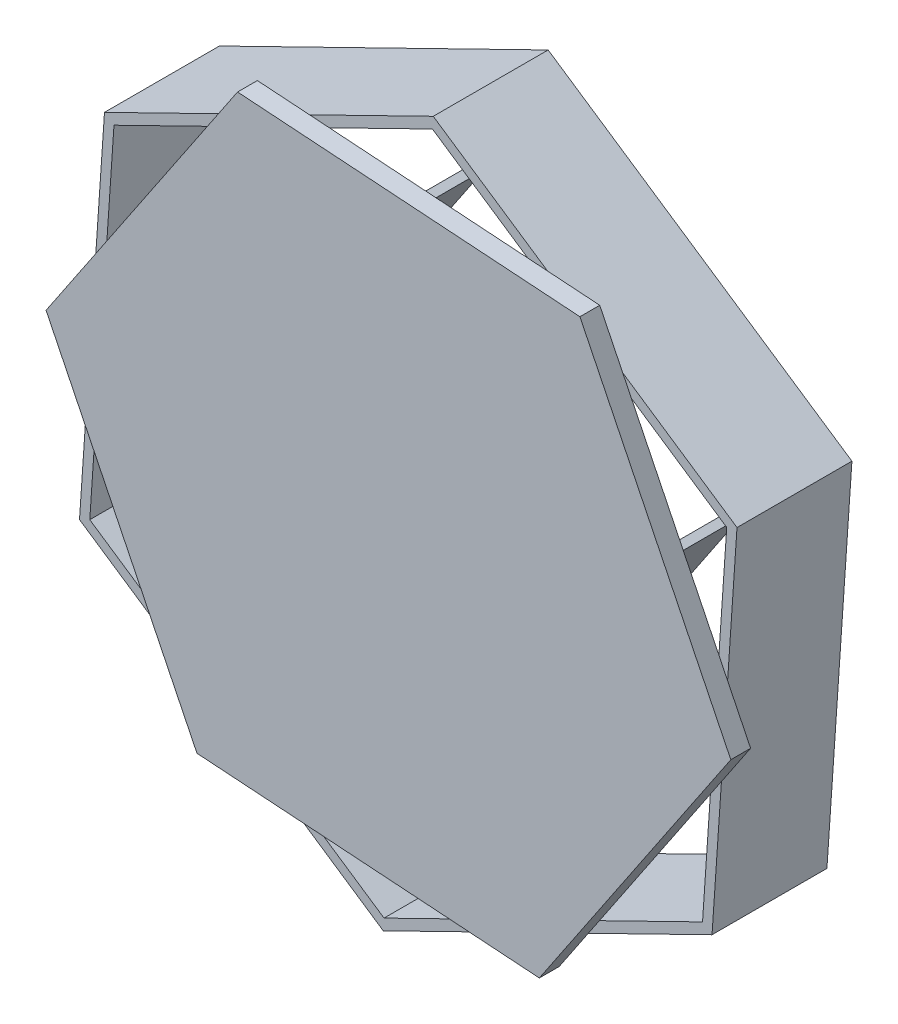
from build123d import *

# Parameters (mm, degrees)
BOSS_EXTRUDE1_DEPTH = 6.35
BOSS_EXTRUDE2_DEPTH = 36.83
SKETCH5_R           = 1.27
CUT_EXTRUDE1_DEPTH  = 12.7
BOSS_EXTRUDE4_DEPTH = 25.4


with BuildPart() as part:
    # Sketch2 → Boss-Extrude1 (new body)
    with BuildSketch(Plane.XY):
        Polygon((61.366987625, 91.273450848), (-48.361633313, 98.782095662), (-109.728620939, 7.508644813), (-61.366987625, -91.273450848), (48.361633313, -98.782095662), (109.728620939, -7.508644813), align=None)
    extrude(amount=-BOSS_EXTRUDE1_DEPTH)

    # Sketch3 → Boss-Extrude2 (add)
    with BuildSketch(Plane(origin=(0, 0, -6.35), x_dir=(-1, 0, 0), z_dir=(0, 0, -1))):
        Polygon((97.358347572, 65.458120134), (-8.009221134, 117.043862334), (-105.367568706, 51.585742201), (-97.358347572, -65.458120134), (8.009221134, -117.043862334), (105.367568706, -51.585742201), align=None)
        Polygon((94.31589921, 63.41255388), (-7.758932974, 113.386241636), (-102.074832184, 49.973687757), (-94.31589921, -63.41255388), (7.758932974, -113.386241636), (102.074832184, -49.973687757), align=None, mode=Mode.SUBTRACT)
    extrude(amount=BOSS_EXTRUDE2_DEPTH)

    # Sketch5 → Cut-Extrude1 (cut)
    with BuildSketch(Plane(origin=(0, 0, -43.18), x_dir=(-1, 0, 0), z_dir=(0, 0, -1))):
        with Locations((43.976523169, 89.825194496)):
            Circle(SKETCH5_R)
        with Locations((99.779161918, 6.827811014)):
            Circle(SKETCH5_R)
        with Locations((55.802638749, -82.997383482)):
            Circle(SKETCH5_R)
        with Locations((-43.976523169, -89.825194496)):
            Circle(SKETCH5_R)
        with Locations((-99.779161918, -6.827811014)):
            Circle(SKETCH5_R)
        with Locations((-55.802638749, 82.997383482)):
            Circle(SKETCH5_R)
    extrude(amount=-CUT_EXTRUDE1_DEPTH, mode=Mode.SUBTRACT)

    # Sketch6 → Boss-Extrude4 (add)
    with BuildSketch(Plane(origin=(0, 0, -6.35), x_dir=(-1, 0, 0), z_dir=(0, 0, -1))):
        Polygon((-3.184129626, -86.310624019), (-1.07625957, -84.893414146), (-79.022802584, 31.039438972), (-81.130672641, 29.622229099), align=None)
        Polygon((79.022802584, -31.039438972), (81.130672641, -29.622229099), (3.184129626, 86.310624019), (1.07625957, 84.893414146), align=None)
        Polygon((37.919336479, -58.675031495), (-40.027206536, 57.257821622), (-37.919336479, 58.675031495), (40.027206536, -57.257821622), align=None)
    extrude(amount=BOSS_EXTRUDE4_DEPTH)


solid = part.part
